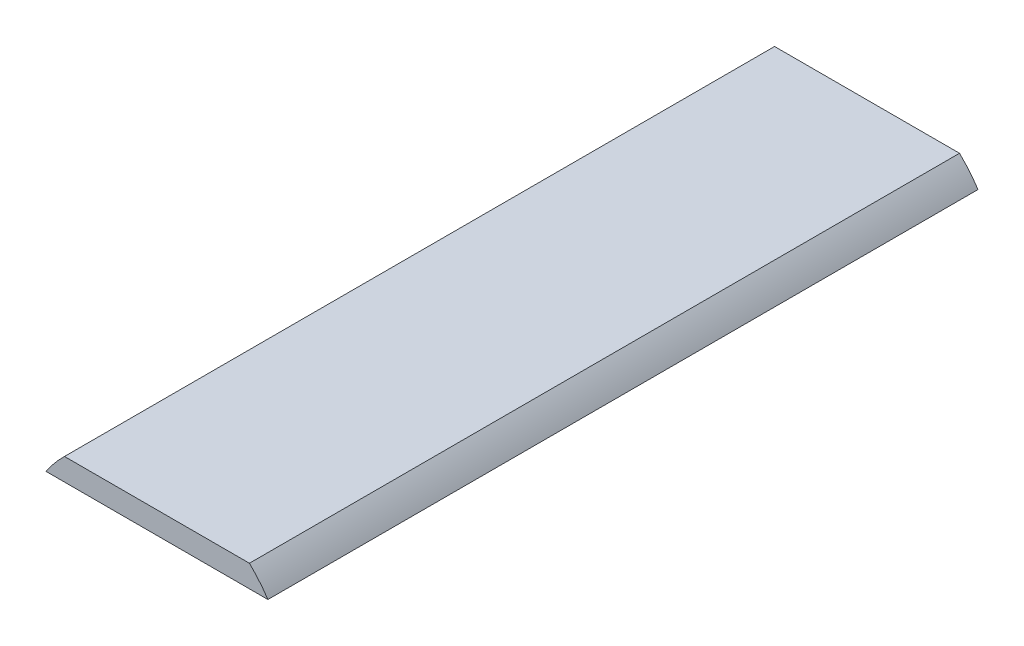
ISO-10303-21;
HEADER;
FILE_DESCRIPTION(('STEP AP214'),'2;1');
FILE_NAME('part.step','',(''),(''),'','','');
FILE_SCHEMA(('AUTOMOTIVE_DESIGN { 1 0 10303 214 1 1 1 1 }'));
ENDSEC;
DATA;
#1=APPLICATION_CONTEXT('core data for automotive mechanical design processes');
#2=APPLICATION_PROTOCOL_DEFINITION('international standard','automotive_design',2000,#1);
#3=PRODUCT_CONTEXT('',#1,'mechanical');
#4=PRODUCT('Part','Part','',(#3));
#5=PRODUCT_RELATED_PRODUCT_CATEGORY('part','',(#4));
#6=PRODUCT_DEFINITION_FORMATION('','',#4);
#7=PRODUCT_DEFINITION_CONTEXT('part definition',#1,'design');
#8=PRODUCT_DEFINITION('design','',#6,#7);
#9=PRODUCT_DEFINITION_SHAPE('','',#8);
#10=(LENGTH_UNIT() NAMED_UNIT(*) SI_UNIT(.MILLI.,.METRE.));
#11=(NAMED_UNIT(*) PLANE_ANGLE_UNIT() SI_UNIT($,.RADIAN.));
#12=(NAMED_UNIT(*) SI_UNIT($,.STERADIAN.) SOLID_ANGLE_UNIT());
#13=UNCERTAINTY_MEASURE_WITH_UNIT(LENGTH_MEASURE(1.E-05),#10,'distance_accuracy_value','');
#14=(GEOMETRIC_REPRESENTATION_CONTEXT(3) GLOBAL_UNCERTAINTY_ASSIGNED_CONTEXT((#13)) GLOBAL_UNIT_ASSIGNED_CONTEXT((#10,
#11,#12)) REPRESENTATION_CONTEXT('',''));
#15=CARTESIAN_POINT('',(0.,0.,0.));
#16=DIRECTION('',(0.,0.,1.));
#17=DIRECTION('',(1.,0.,0.));
#18=AXIS2_PLACEMENT_3D('',#15,#16,#17);
#19=CARTESIAN_POINT('',(0.,0.,101.6));
#20=DIRECTION('',(0.,0.,-1.));
#21=DIRECTION('',(-1.,0.,0.));
#22=AXIS2_PLACEMENT_3D('',#19,#20,#21);
#23=CYLINDRICAL_SURFACE('',#22,19.05);
#24=CARTESIAN_POINT('',(0.,0.,101.6));
#25=DIRECTION('',(0.,0.,1.));
#26=DIRECTION('',(1.,0.,0.));
#27=AXIS2_PLACEMENT_3D('',#24,#25,#26);
#28=CIRCLE('',#27,19.05);
#29=CARTESIAN_POINT('',(15.875,10.5302837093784,101.6));
#30=VERTEX_POINT('',#29);
#31=CARTESIAN_POINT('',(13.2313150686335,13.7052837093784,101.6));
#32=VERTEX_POINT('',#31);
#33=EDGE_CURVE('E39',#30,#32,#28,.T.);
#34=ORIENTED_EDGE('',*,*,#33,.F.);
#35=DIRECTION('',(0.,0.,1.));
#36=VECTOR('',#35,1.);
#37=CARTESIAN_POINT('',(15.875,10.5302837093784,0.));
#38=LINE('',#37,#36);
#39=CARTESIAN_POINT('',(15.875,10.5302837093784,0.));
#40=VERTEX_POINT('',#39);
#41=EDGE_CURVE('E71',#40,#30,#38,.T.);
#42=ORIENTED_EDGE('',*,*,#41,.F.);
#43=CARTESIAN_POINT('',(0.,0.,0.));
#44=DIRECTION('',(0.,0.,1.));
#45=DIRECTION('',(1.,0.,0.));
#46=AXIS2_PLACEMENT_3D('',#43,#44,#45);
#47=CIRCLE('',#46,19.05);
#48=CARTESIAN_POINT('',(13.2313150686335,13.7052837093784,0.));
#49=VERTEX_POINT('',#48);
#50=EDGE_CURVE('E54',#40,#49,#47,.T.);
#51=ORIENTED_EDGE('',*,*,#50,.T.);
#52=DIRECTION('',(0.,0.,1.));
#53=VECTOR('',#52,1.);
#54=CARTESIAN_POINT('',(13.2313150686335,13.7052837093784,0.));
#55=LINE('',#54,#53);
#56=EDGE_CURVE('E84',#49,#32,#55,.T.);
#57=ORIENTED_EDGE('',*,*,#56,.T.);
#58=EDGE_LOOP('',(#34,#42,#51,#57));
#59=FACE_BOUND('',#58,.T.);
#60=ADVANCED_FACE('F31',(#59),#23,.T.);
#61=CARTESIAN_POINT('',(-13.2313150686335,13.7052837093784,0.));
#62=VERTEX_POINT('',#61);
#63=CARTESIAN_POINT('',(-15.875,10.5302837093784,0.));
#64=VERTEX_POINT('',#63);
#65=EDGE_CURVE('E85',#62,#64,#47,.T.);
#66=ORIENTED_EDGE('',*,*,#65,.T.);
#67=DIRECTION('',(0.,0.,1.));
#68=VECTOR('',#67,1.);
#69=CARTESIAN_POINT('',(-15.875,10.5302837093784,0.));
#70=LINE('',#69,#68);
#71=CARTESIAN_POINT('',(-15.875,10.5302837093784,101.6));
#72=VERTEX_POINT('',#71);
#73=EDGE_CURVE('E46',#64,#72,#70,.T.);
#74=ORIENTED_EDGE('',*,*,#73,.T.);
#75=CARTESIAN_POINT('',(-13.2313150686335,13.7052837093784,101.6));
#76=VERTEX_POINT('',#75);
#77=EDGE_CURVE('E11',#76,#72,#28,.T.);
#78=ORIENTED_EDGE('',*,*,#77,.F.);
#79=DIRECTION('',(0.,0.,1.));
#80=VECTOR('',#79,1.);
#81=CARTESIAN_POINT('',(-13.2313150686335,13.7052837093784,0.));
#82=LINE('',#81,#80);
#83=EDGE_CURVE('E91',#62,#76,#82,.T.);
#84=ORIENTED_EDGE('',*,*,#83,.F.);
#85=EDGE_LOOP('',(#66,#74,#78,#84));
#86=FACE_BOUND('',#85,.T.);
#87=ADVANCED_FACE('F33',(#86),#23,.T.);
#88=CARTESIAN_POINT('',(0.,0.,101.6));
#89=DIRECTION('',(0.,0.,1.));
#90=DIRECTION('',(1.,0.,0.));
#91=AXIS2_PLACEMENT_3D('',#88,#89,#90);
#92=PLANE('',#91);
#93=DIRECTION('',(-1.,0.,0.));
#94=VECTOR('',#93,1.);
#95=CARTESIAN_POINT('',(-15.875,10.5302837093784,101.6));
#96=LINE('',#95,#94);
#97=EDGE_CURVE('E74',#30,#72,#96,.T.);
#98=ORIENTED_EDGE('',*,*,#97,.F.);
#99=ORIENTED_EDGE('',*,*,#33,.T.);
#100=DIRECTION('',(1.,0.,0.));
#101=VECTOR('',#100,1.);
#102=CARTESIAN_POINT('',(-13.2313150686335,13.7052837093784,101.6));
#103=LINE('',#102,#101);
#104=EDGE_CURVE('E97',#76,#32,#103,.T.);
#105=ORIENTED_EDGE('',*,*,#104,.F.);
#106=ORIENTED_EDGE('',*,*,#77,.T.);
#107=EDGE_LOOP('',(#98,#99,#105,#106));
#108=FACE_BOUND('',#107,.T.);
#109=ADVANCED_FACE('F79',(#108),#92,.T.);
#110=CARTESIAN_POINT('',(0.,0.,0.));
#111=DIRECTION('',(0.,0.,1.));
#112=DIRECTION('',(1.,0.,0.));
#113=AXIS2_PLACEMENT_3D('',#110,#111,#112);
#114=PLANE('',#113);
#115=ORIENTED_EDGE('',*,*,#50,.F.);
#116=DIRECTION('',(-1.,0.,0.));
#117=VECTOR('',#116,1.);
#118=CARTESIAN_POINT('',(-15.875,10.5302837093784,0.));
#119=LINE('',#118,#117);
#120=EDGE_CURVE('E75',#40,#64,#119,.T.);
#121=ORIENTED_EDGE('',*,*,#120,.T.);
#122=ORIENTED_EDGE('',*,*,#65,.F.);
#123=DIRECTION('',(1.,0.,0.));
#124=VECTOR('',#123,1.);
#125=CARTESIAN_POINT('',(-13.2313150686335,13.7052837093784,0.));
#126=LINE('',#125,#124);
#127=EDGE_CURVE('E93',#62,#49,#126,.T.);
#128=ORIENTED_EDGE('',*,*,#127,.T.);
#129=EDGE_LOOP('',(#115,#121,#122,#128));
#130=FACE_BOUND('',#129,.T.);
#131=ADVANCED_FACE('F101',(#130),#114,.F.);
#132=CARTESIAN_POINT('',(-13.2313150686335,13.7052837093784,0.));
#133=DIRECTION('',(0.,-1.,0.));
#134=DIRECTION('',(0.,0.,-1.));
#135=AXIS2_PLACEMENT_3D('',#132,#133,#134);
#136=PLANE('',#135);
#137=ORIENTED_EDGE('',*,*,#104,.T.);
#138=ORIENTED_EDGE('',*,*,#56,.F.);
#139=ORIENTED_EDGE('',*,*,#127,.F.);
#140=ORIENTED_EDGE('',*,*,#83,.T.);
#141=EDGE_LOOP('',(#137,#138,#139,#140));
#142=FACE_BOUND('',#141,.T.);
#143=ADVANCED_FACE('F103',(#142),#136,.F.);
#144=CARTESIAN_POINT('',(-15.875,10.5302837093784,0.));
#145=DIRECTION('',(0.,1.,0.));
#146=DIRECTION('',(0.,0.,1.));
#147=AXIS2_PLACEMENT_3D('',#144,#145,#146);
#148=PLANE('',#147);
#149=ORIENTED_EDGE('',*,*,#97,.T.);
#150=ORIENTED_EDGE('',*,*,#73,.F.);
#151=ORIENTED_EDGE('',*,*,#120,.F.);
#152=ORIENTED_EDGE('',*,*,#41,.T.);
#153=EDGE_LOOP('',(#149,#150,#151,#152));
#154=FACE_BOUND('',#153,.T.);
#155=ADVANCED_FACE('F73',(#154),#148,.F.);
#156=CLOSED_SHELL('',(#60,#87,#109,#131,#143,#155));
#157=MANIFOLD_SOLID_BREP('B2',#156);
#158=ADVANCED_BREP_SHAPE_REPRESENTATION('',(#18,#157),#14);
#159=SHAPE_DEFINITION_REPRESENTATION(#9,#158);
ENDSEC;
END-ISO-10303-21;
